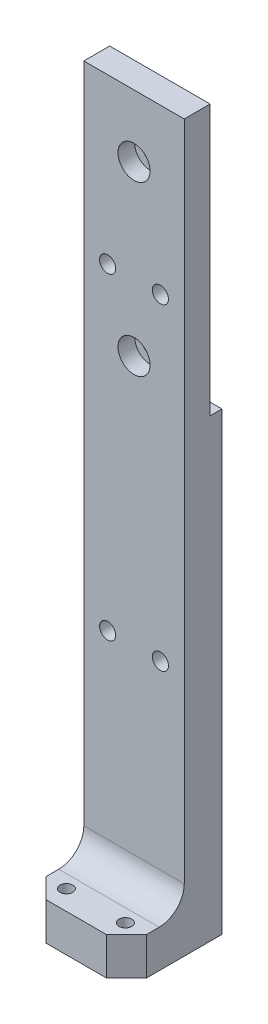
from build123d import *

# Parameters (mm, degrees)
SKETCH1_W                                      = 20.32
SKETCH1_H                                      = 69.85
EXTRUDE1_DEPTH                                 = 15.24
SKETCH4_W                                      = 20.32
SKETCH4_H                                      = 8.382
CUT_EXTRUDE3_DEPTH                             = 73.211534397
SKETCH5_W                                      = 20.32
SKETCH5_H                                      = 7.62
EXTRUDE2_DEPTH                                 = 24.511
SKETCH10_W                                     = 20.32
SKETCH10_H                                     = 7.62
EXTRUDE3_DEPTH                                 = 11.695303
SKETCH12_W                                     = 20.32
SKETCH12_H                                     = 15.24
EXTRUDE5_DEPTH                                 = 60.706
SKETCH11_W                                     = 20.32
SKETCH11_H                                     = 122.174
CUT_EXTRUDE4_DEPTH                             = 7.62
FILLET1_R                                      = 5.08
F_5_40_TAPPED_HOLE1_D                          = 2.5781
F_5_40_TAPPED_HOLE1_DEPTH                      = 8.255
F_5_40_TAPPED_HOLE1_TIP                        = 0.774539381
CHAMFER2_SIZE                                  = 4.064
CUT_EXTRUDE7_DEPTH                             = 12.7
CSK_FOR_4_FLAT_HEAD_MACHINE_SCREW2_D           = 3.2639
CSK_FOR_4_FLAT_HEAD_MACHINE_SCREW2_CSINK_D     = 6.3774066
CSK_FOR_4_FLAT_HEAD_MACHINE_SCREW2_CSINK_ANGLE = 82
SKETCH24_W                                     = 2.3876
SKETCH24_H                                     = 54.61
CUT_EXTRUDE8_DEPTH                             = 101.21183198
CSK_FOR_4_FLAT_HEAD_MACHINE_SCREW1_D           = 3.2639
CSK_FOR_4_FLAT_HEAD_MACHINE_SCREW1_CSINK_D     = 6.3774066
CSK_FOR_4_FLAT_HEAD_MACHINE_SCREW1_CSINK_ANGLE = 82
CBORE_FOR_M3_SHCS2_D                           = 3.2
CBORE_FOR_M3_SHCS2_CBORE_D                     = 6.5
CBORE_FOR_M3_SHCS2_CBORE_DEPTH                 = 3.381
M3X0_5_TAPPED_HOLE1_D                          = 2.5
M3X0_5_TAPPED_HOLE1_DEPTH                      = 7.62
M3X0_5_TAPPED_HOLE1_TIP                        = 0.751075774


with BuildPart() as part:
    # Sketch1 → Extrude1 (new body)
    with BuildSketch(Plane.XY):
        with Locations((0, -34.925)):
            Rectangle(SKETCH1_W, SKETCH1_H)
    extrude(amount=EXTRUDE1_DEPTH)

    # Sketch4 → Cut-Extrude3 (cut, through all)
    with BuildSketch(Plane.XY):
        with Locations((0, -4.191)):
            Rectangle(SKETCH4_W, SKETCH4_H)
    extrude(amount=CUT_EXTRUDE3_DEPTH, mode=Mode.SUBTRACT)

    # Sketch5 → Extrude2 (add)
    with BuildSketch(Plane.XZ.offset(69.85)):
        with Locations((0, 11.43)):
            Rectangle(SKETCH5_W, SKETCH5_H)
    extrude(amount=EXTRUDE2_DEPTH)

    # Sketch10 → Extrude3 (add)
    with BuildSketch(Plane.XY.offset(15.24)):
        with Locations((0, -90.551)):
            Rectangle(SKETCH10_W, SKETCH10_H)
    extrude(amount=EXTRUDE3_DEPTH)

    # Sketch12 → Extrude5 (add)
    with BuildSketch(Plane(origin=(0, -8.382, 0), x_dir=(-1, 0, 0), z_dir=(0, 1, 0))):
        with Locations((0, 7.62)):
            Rectangle(SKETCH12_W, SKETCH12_H)
    extrude(amount=EXTRUDE5_DEPTH)

    # Sketch11 → Cut-Extrude4 (cut)
    with BuildSketch(Plane(origin=(0, 0, 0), x_dir=(-1, 0, 0), z_dir=(0, 0, -1))):
        with Locations((0, -8.763)):
            Rectangle(SKETCH11_W, SKETCH11_H)
    extrude(amount=-CUT_EXTRUDE4_DEPTH, mode=Mode.SUBTRACT)

    # Fillet1
    fillet1_edges = [part.edges().sort_by_distance(p)[0] for p in [
        (0, -86.741, 15.24),
    ]]
    fillet(fillet1_edges, radius=FILLET1_R)

    # 5-40 Tapped Hole1
    with Locations(Plane.XZ.offset(94.361)):
        with Locations((5.969, 11.603781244), (-5.969, 11.603781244), (-5.969, 22.951521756), (5.969, 22.951521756)):
            Hole(F_5_40_TAPPED_HOLE1_D / 2, depth=F_5_40_TAPPED_HOLE1_DEPTH)
            with Locations((0, 0, -(F_5_40_TAPPED_HOLE1_DEPTH + F_5_40_TAPPED_HOLE1_TIP / 2))):  # 118° drill point
                Cone(0, F_5_40_TAPPED_HOLE1_D / 2, F_5_40_TAPPED_HOLE1_TIP, mode=Mode.SUBTRACT)

    # Chamfer2
    chamfer2_edges = [part.edges().sort_by_distance(p)[0] for p in [
        (10.16, -90.551, 26.935303),
        (-10.16, -90.551, 26.935303),
    ]]
    chamfer(chamfer2_edges, length=CHAMFER2_SIZE)

    # Sketch17 → Cut-Extrude7 (cut)
    with BuildSketch(Plane.XZ.offset(94.361)):
        Polygon((-10.16, 7.62), (-6.096, 7.62), (-10.16, 11.684), align=None)
    extrude(amount=-CUT_EXTRUDE7_DEPTH, mode=Mode.SUBTRACT)

    # CSK for _4 Flat Head Machine Screw2 (through all)
    with Locations(Plane(origin=(0, 0, 7.62), x_dir=(-1, 0, 0), z_dir=(0, 0, -1))):
        with Locations((5.334, -45.085)):
            csk_for_4_flat_head_machine_screw2 = CounterSinkHole(CSK_FOR_4_FLAT_HEAD_MACHINE_SCREW2_D / 2, CSK_FOR_4_FLAT_HEAD_MACHINE_SCREW2_CSINK_D / 2, counter_sink_angle=CSK_FOR_4_FLAT_HEAD_MACHINE_SCREW2_CSINK_ANGLE)

    # Sketch24 → Cut-Extrude8 (cut, through all)
    with BuildSketch(Plane.ZY.offset(10.16)):
        with Locations((8.8138, 25.019)):
            Rectangle(SKETCH24_W, SKETCH24_H)
    extrude(amount=-CUT_EXTRUDE8_DEPTH, mode=Mode.SUBTRACT)

    # CSK for _4 Flat Head Machine Screw1 (through all)
    with Locations(Plane(origin=(-5.334, 19.151892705, 10.0076), x_dir=(0, -1, 0), z_dir=(0, 0, -1))):
        with Locations((0, 0)):
            csk_for_4_flat_head_machine_screw1 = CounterSinkHole(CSK_FOR_4_FLAT_HEAD_MACHINE_SCREW1_D / 2, CSK_FOR_4_FLAT_HEAD_MACHINE_SCREW1_CSINK_D / 2, counter_sink_angle=CSK_FOR_4_FLAT_HEAD_MACHINE_SCREW1_CSINK_ANGLE)

    # CBORE for M3 SHCS2 (through all)
    with Locations(Plane(origin=(0, 5.715, 15.24), x_dir=(1, 0, 0), z_dir=(0, 0, 1))):
        with Locations((0, 0), (0, 34.0106)):
            CounterBoreHole(CBORE_FOR_M3_SHCS2_D / 2, CBORE_FOR_M3_SHCS2_CBORE_D / 2, CBORE_FOR_M3_SHCS2_CBORE_DEPTH)

    # M3x0.5 Tapped Hole1
    with Locations(Plane(origin=(-10.16, -30.861, 11.43), x_dir=(0, -1, 0), z_dir=(-1, 0, 0))):
        with Locations((0, 0)):
            Hole(M3X0_5_TAPPED_HOLE1_D / 2, depth=M3X0_5_TAPPED_HOLE1_DEPTH)
            with Locations((0, 0, -(M3X0_5_TAPPED_HOLE1_DEPTH + M3X0_5_TAPPED_HOLE1_TIP / 2))):  # 118° drill point
                Cone(0, M3X0_5_TAPPED_HOLE1_D / 2, M3X0_5_TAPPED_HOLE1_TIP, mode=Mode.SUBTRACT)

    # Mirror1: CSK for _4 Flat Head Machine Screw2, CSK for _4 Flat Head Machine Screw1 across plane
    add(csk_for_4_flat_head_machine_screw2.mirror(Plane(origin=(0, 0, 0), x_dir=(0, 0, 1), z_dir=(1, 0, 0))), mode=Mode.SUBTRACT)
    add(csk_for_4_flat_head_machine_screw1.mirror(Plane(origin=(0, 0, 0), x_dir=(0, 0, 1), z_dir=(1, 0, 0))), mode=Mode.SUBTRACT)


solid = part.part
